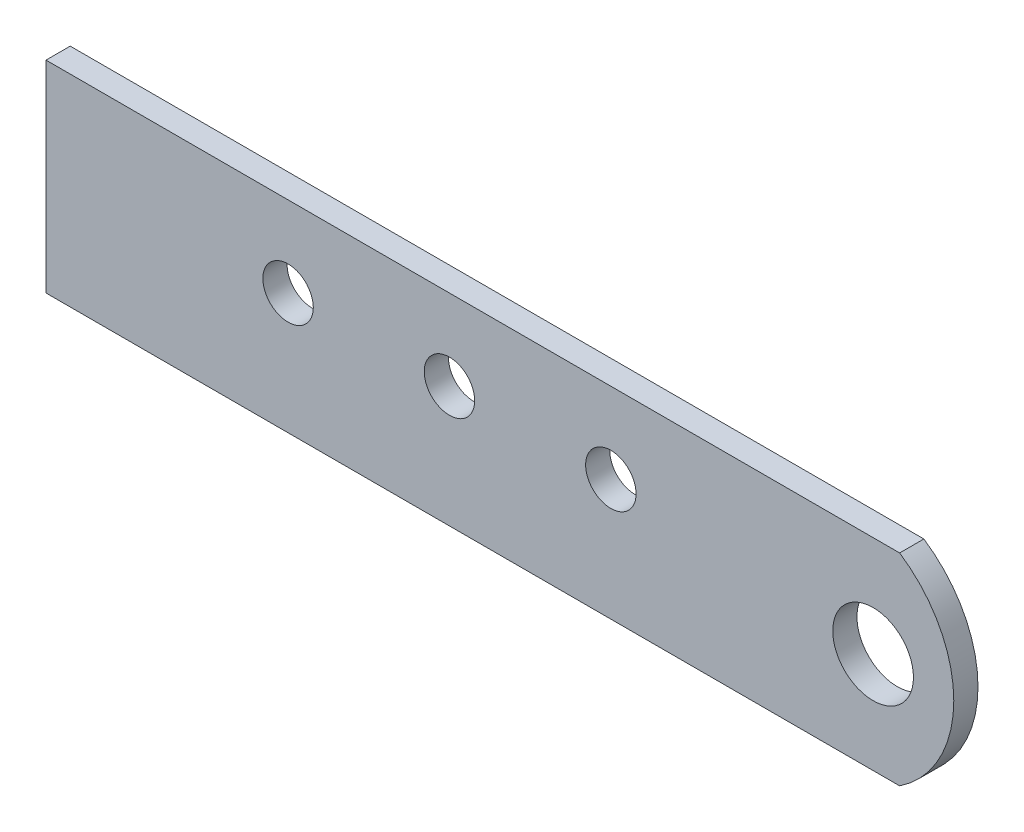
from build123d import *

# Parameters (mm, degrees)
ESQUISSE1_R      = 20
ESQUISSE1_R_2    = 12.5
EXTRUSION1_DEPTH = 12


with BuildPart() as part:
    # Esquisse1 → Extrusion1 (new body)
    with BuildSketch(Plane.XY):
        with BuildLine():
            Line((0, 0), (423.166247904, 0))
            ThreePointArc((423.166247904, 0), (450, -50), (423.166247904, -100))
            Line((423.166247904, -100), (0, -100))
            Line((0, -100), (0, 0))
        make_face()
        with Locations((410, -50)):
            Circle(ESQUISSE1_R, mode=Mode.SUBTRACT)
        with Locations((120, -40)):
            Circle(ESQUISSE1_R_2, mode=Mode.SUBTRACT)
        with Locations((200, -40)):
            Circle(ESQUISSE1_R_2, mode=Mode.SUBTRACT)
        with Locations((280, -40)):
            Circle(ESQUISSE1_R_2, mode=Mode.SUBTRACT)
    extrude(amount=EXTRUSION1_DEPTH)


solid = part.part
